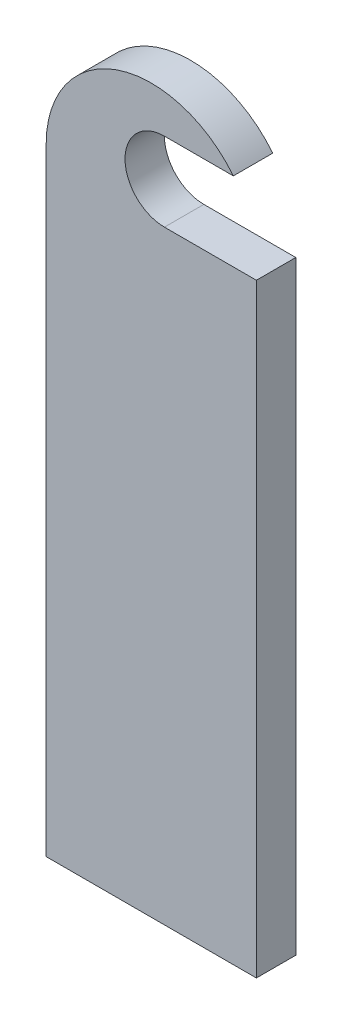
ISO-10303-21;
HEADER;
FILE_DESCRIPTION(('STEP AP214'),'2;1');
FILE_NAME('part.step','',(''),(''),'','','');
FILE_SCHEMA(('AUTOMOTIVE_DESIGN { 1 0 10303 214 1 1 1 1 }'));
ENDSEC;
DATA;
#1=APPLICATION_CONTEXT('core data for automotive mechanical design processes');
#2=APPLICATION_PROTOCOL_DEFINITION('international standard','automotive_design',2000,#1);
#3=PRODUCT_CONTEXT('',#1,'mechanical');
#4=PRODUCT('Part','Part','',(#3));
#5=PRODUCT_RELATED_PRODUCT_CATEGORY('part','',(#4));
#6=PRODUCT_DEFINITION_FORMATION('','',#4);
#7=PRODUCT_DEFINITION_CONTEXT('part definition',#1,'design');
#8=PRODUCT_DEFINITION('design','',#6,#7);
#9=PRODUCT_DEFINITION_SHAPE('','',#8);
#10=(LENGTH_UNIT() NAMED_UNIT(*) SI_UNIT(.MILLI.,.METRE.));
#11=(NAMED_UNIT(*) PLANE_ANGLE_UNIT() SI_UNIT($,.RADIAN.));
#12=(NAMED_UNIT(*) SI_UNIT($,.STERADIAN.) SOLID_ANGLE_UNIT());
#13=UNCERTAINTY_MEASURE_WITH_UNIT(LENGTH_MEASURE(1.E-05),#10,'distance_accuracy_value','');
#14=(GEOMETRIC_REPRESENTATION_CONTEXT(3) GLOBAL_UNCERTAINTY_ASSIGNED_CONTEXT((#13)) GLOBAL_UNIT_ASSIGNED_CONTEXT((#10,
#11,#12)) REPRESENTATION_CONTEXT('',''));
#15=CARTESIAN_POINT('',(0.,0.,0.));
#16=DIRECTION('',(0.,0.,1.));
#17=DIRECTION('',(1.,0.,0.));
#18=AXIS2_PLACEMENT_3D('',#15,#16,#17);
#19=CARTESIAN_POINT('',(-8.00000000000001,47.,3.));
#20=DIRECTION('',(1.,0.,0.));
#21=DIRECTION('',(0.,1.,0.));
#22=AXIS2_PLACEMENT_3D('',#19,#20,#21);
#23=PLANE('',#22);
#24=DIRECTION('',(0.,-1.,0.));
#25=VECTOR('',#24,1.);
#26=CARTESIAN_POINT('',(-8.00000000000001,47.,0.));
#27=LINE('',#26,#25);
#28=CARTESIAN_POINT('',(-8.00000000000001,47.,0.));
#29=VERTEX_POINT('',#28);
#30=CARTESIAN_POINT('',(-8.,0.,0.));
#31=VERTEX_POINT('',#30);
#32=EDGE_CURVE('E123',#29,#31,#27,.T.);
#33=ORIENTED_EDGE('',*,*,#32,.T.);
#34=DIRECTION('',(0.,0.,-1.));
#35=VECTOR('',#34,1.);
#36=CARTESIAN_POINT('',(-8.,0.,3.));
#37=LINE('',#36,#35);
#38=CARTESIAN_POINT('',(-8.,0.,3.));
#39=VERTEX_POINT('',#38);
#40=EDGE_CURVE('E11',#39,#31,#37,.T.);
#41=ORIENTED_EDGE('',*,*,#40,.F.);
#42=DIRECTION('',(0.,-1.,0.));
#43=VECTOR('',#42,1.);
#44=CARTESIAN_POINT('',(-8.00000000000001,47.,3.));
#45=LINE('',#44,#43);
#46=CARTESIAN_POINT('',(-8.00000000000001,47.,3.));
#47=VERTEX_POINT('',#46);
#48=EDGE_CURVE('E135',#47,#39,#45,.T.);
#49=ORIENTED_EDGE('',*,*,#48,.F.);
#50=DIRECTION('',(0.,0.,-1.));
#51=VECTOR('',#50,1.);
#52=CARTESIAN_POINT('',(-8.00000000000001,47.,3.));
#53=LINE('',#52,#51);
#54=EDGE_CURVE('E119',#47,#29,#53,.T.);
#55=ORIENTED_EDGE('',*,*,#54,.T.);
#56=EDGE_LOOP('',(#33,#41,#49,#55));
#57=FACE_BOUND('',#56,.T.);
#58=ADVANCED_FACE('F33',(#57),#23,.F.);
#59=CARTESIAN_POINT('',(-8.,0.,3.));
#60=DIRECTION('',(0.,1.,0.));
#61=DIRECTION('',(0.,0.,1.));
#62=AXIS2_PLACEMENT_3D('',#59,#60,#61);
#63=PLANE('',#62);
#64=DIRECTION('',(1.,0.,0.));
#65=VECTOR('',#64,1.);
#66=CARTESIAN_POINT('',(-8.,0.,0.));
#67=LINE('',#66,#65);
#68=CARTESIAN_POINT('',(8.,0.,0.));
#69=VERTEX_POINT('',#68);
#70=EDGE_CURVE('E126',#31,#69,#67,.T.);
#71=ORIENTED_EDGE('',*,*,#70,.T.);
#72=DIRECTION('',(0.,0.,-1.));
#73=VECTOR('',#72,1.);
#74=CARTESIAN_POINT('',(8.,0.,3.));
#75=LINE('',#74,#73);
#76=CARTESIAN_POINT('',(8.,0.,3.));
#77=VERTEX_POINT('',#76);
#78=EDGE_CURVE('E41',#77,#69,#75,.T.);
#79=ORIENTED_EDGE('',*,*,#78,.F.);
#80=DIRECTION('',(1.,0.,0.));
#81=VECTOR('',#80,1.);
#82=CARTESIAN_POINT('',(-8.,0.,3.));
#83=LINE('',#82,#81);
#84=EDGE_CURVE('E89',#39,#77,#83,.T.);
#85=ORIENTED_EDGE('',*,*,#84,.F.);
#86=ORIENTED_EDGE('',*,*,#40,.T.);
#87=EDGE_LOOP('',(#71,#79,#85,#86));
#88=FACE_BOUND('',#87,.T.);
#89=ADVANCED_FACE('F160',(#88),#63,.F.);
#90=CARTESIAN_POINT('',(8.,0.,3.));
#91=DIRECTION('',(-1.,0.,0.));
#92=DIRECTION('',(0.,-1.,0.));
#93=AXIS2_PLACEMENT_3D('',#90,#91,#92);
#94=PLANE('',#93);
#95=DIRECTION('',(0.,1.,0.));
#96=VECTOR('',#95,1.);
#97=CARTESIAN_POINT('',(8.,0.,0.));
#98=LINE('',#97,#96);
#99=CARTESIAN_POINT('',(7.99999999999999,46.,0.));
#100=VERTEX_POINT('',#99);
#101=EDGE_CURVE('E128',#69,#100,#98,.T.);
#102=ORIENTED_EDGE('',*,*,#101,.T.);
#103=DIRECTION('',(0.,0.,-1.));
#104=VECTOR('',#103,1.);
#105=CARTESIAN_POINT('',(7.99999999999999,46.,3.));
#106=LINE('',#105,#104);
#107=CARTESIAN_POINT('',(7.99999999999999,46.,3.));
#108=VERTEX_POINT('',#107);
#109=EDGE_CURVE('E139',#108,#100,#106,.T.);
#110=ORIENTED_EDGE('',*,*,#109,.F.);
#111=DIRECTION('',(0.,1.,0.));
#112=VECTOR('',#111,1.);
#113=CARTESIAN_POINT('',(8.,0.,3.));
#114=LINE('',#113,#112);
#115=EDGE_CURVE('E147',#77,#108,#114,.T.);
#116=ORIENTED_EDGE('',*,*,#115,.F.);
#117=ORIENTED_EDGE('',*,*,#78,.T.);
#118=EDGE_LOOP('',(#102,#110,#116,#117));
#119=FACE_BOUND('',#118,.T.);
#120=ADVANCED_FACE('F145',(#119),#94,.F.);
#121=CARTESIAN_POINT('',(7.99999999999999,46.,3.));
#122=DIRECTION('',(0.,-1.,0.));
#123=DIRECTION('',(0.,0.,-1.));
#124=AXIS2_PLACEMENT_3D('',#121,#122,#123);
#125=PLANE('',#124);
#126=DIRECTION('',(-1.,0.,0.));
#127=VECTOR('',#126,1.);
#128=CARTESIAN_POINT('',(7.99999999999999,46.,0.));
#129=LINE('',#128,#127);
#130=CARTESIAN_POINT('',(0.999999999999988,46.,0.));
#131=VERTEX_POINT('',#130);
#132=EDGE_CURVE('E130',#100,#131,#129,.T.);
#133=ORIENTED_EDGE('',*,*,#132,.T.);
#134=DIRECTION('',(0.,0.,-1.));
#135=VECTOR('',#134,1.);
#136=CARTESIAN_POINT('',(0.999999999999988,46.,3.));
#137=LINE('',#136,#135);
#138=CARTESIAN_POINT('',(0.999999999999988,46.,3.));
#139=VERTEX_POINT('',#138);
#140=EDGE_CURVE('E114',#139,#131,#137,.T.);
#141=ORIENTED_EDGE('',*,*,#140,.F.);
#142=DIRECTION('',(-1.,0.,0.));
#143=VECTOR('',#142,1.);
#144=CARTESIAN_POINT('',(7.99999999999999,46.,3.));
#145=LINE('',#144,#143);
#146=EDGE_CURVE('E105',#108,#139,#145,.T.);
#147=ORIENTED_EDGE('',*,*,#146,.F.);
#148=ORIENTED_EDGE('',*,*,#109,.T.);
#149=EDGE_LOOP('',(#133,#141,#147,#148));
#150=FACE_BOUND('',#149,.T.);
#151=ADVANCED_FACE('F153',(#150),#125,.F.);
#152=CARTESIAN_POINT('',(0.999999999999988,49.,3.));
#153=DIRECTION('',(0.,0.,-1.));
#154=DIRECTION('',(-1.,0.,0.));
#155=AXIS2_PLACEMENT_3D('',#152,#153,#154);
#156=CYLINDRICAL_SURFACE('',#155,3.);
#157=CARTESIAN_POINT('',(0.999999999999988,49.,0.));
#158=DIRECTION('',(0.,0.,-1.));
#159=DIRECTION('',(-1.,0.,0.));
#160=AXIS2_PLACEMENT_3D('',#157,#158,#159);
#161=CIRCLE('',#160,3.);
#162=CARTESIAN_POINT('',(0.999999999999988,52.,0.));
#163=VERTEX_POINT('',#162);
#164=EDGE_CURVE('E113',#131,#163,#161,.T.);
#165=ORIENTED_EDGE('',*,*,#164,.T.);
#166=DIRECTION('',(0.,0.,-1.));
#167=VECTOR('',#166,1.);
#168=CARTESIAN_POINT('',(0.999999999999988,52.,3.));
#169=LINE('',#168,#167);
#170=CARTESIAN_POINT('',(0.999999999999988,52.,3.));
#171=VERTEX_POINT('',#170);
#172=EDGE_CURVE('E110',#171,#163,#169,.T.);
#173=ORIENTED_EDGE('',*,*,#172,.F.);
#174=CARTESIAN_POINT('',(0.999999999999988,49.,3.));
#175=DIRECTION('',(0.,0.,-1.));
#176=DIRECTION('',(-1.,0.,0.));
#177=AXIS2_PLACEMENT_3D('',#174,#175,#176);
#178=CIRCLE('',#177,3.);
#179=EDGE_CURVE('E99',#139,#171,#178,.T.);
#180=ORIENTED_EDGE('',*,*,#179,.F.);
#181=ORIENTED_EDGE('',*,*,#140,.T.);
#182=EDGE_LOOP('',(#165,#173,#180,#181));
#183=FACE_BOUND('',#182,.T.);
#184=ADVANCED_FACE('F111',(#183),#156,.F.);
#185=CARTESIAN_POINT('',(0.999999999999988,52.,3.));
#186=DIRECTION('',(0.,1.,0.));
#187=DIRECTION('',(-1.,0.,0.));
#188=AXIS2_PLACEMENT_3D('',#185,#186,#187);
#189=PLANE('',#188);
#190=DIRECTION('',(1.,0.,0.));
#191=VECTOR('',#190,1.);
#192=CARTESIAN_POINT('',(0.999999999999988,52.,0.));
#193=LINE('',#192,#191);
#194=CARTESIAN_POINT('',(6.2449979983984,52.,0.));
#195=VERTEX_POINT('',#194);
#196=EDGE_CURVE('E75',#163,#195,#193,.T.);
#197=ORIENTED_EDGE('',*,*,#196,.T.);
#198=DIRECTION('',(0.,0.,-1.));
#199=VECTOR('',#198,1.);
#200=CARTESIAN_POINT('',(6.2449979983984,52.,3.));
#201=LINE('',#200,#199);
#202=CARTESIAN_POINT('',(6.2449979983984,52.,3.));
#203=VERTEX_POINT('',#202);
#204=EDGE_CURVE('E115',#203,#195,#201,.T.);
#205=ORIENTED_EDGE('',*,*,#204,.F.);
#206=DIRECTION('',(1.,0.,0.));
#207=VECTOR('',#206,1.);
#208=CARTESIAN_POINT('',(0.999999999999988,52.,3.));
#209=LINE('',#208,#207);
#210=EDGE_CURVE('E103',#171,#203,#209,.T.);
#211=ORIENTED_EDGE('',*,*,#210,.F.);
#212=ORIENTED_EDGE('',*,*,#172,.T.);
#213=EDGE_LOOP('',(#197,#205,#211,#212));
#214=FACE_BOUND('',#213,.T.);
#215=ADVANCED_FACE('F117',(#214),#189,.F.);
#216=CARTESIAN_POINT('',(0.,47.,3.));
#217=DIRECTION('',(0.,0.,-1.));
#218=DIRECTION('',(-1.,0.,0.));
#219=AXIS2_PLACEMENT_3D('',#216,#217,#218);
#220=CYLINDRICAL_SURFACE('',#219,8.);
#221=CARTESIAN_POINT('',(0.,47.,0.));
#222=DIRECTION('',(0.,0.,1.));
#223=DIRECTION('',(1.,0.,0.));
#224=AXIS2_PLACEMENT_3D('',#221,#222,#223);
#225=CIRCLE('',#224,8.);
#226=EDGE_CURVE('E81',#195,#29,#225,.T.);
#227=ORIENTED_EDGE('',*,*,#226,.T.);
#228=ORIENTED_EDGE('',*,*,#54,.F.);
#229=CARTESIAN_POINT('',(0.,47.,3.));
#230=DIRECTION('',(0.,0.,1.));
#231=DIRECTION('',(1.,0.,0.));
#232=AXIS2_PLACEMENT_3D('',#229,#230,#231);
#233=CIRCLE('',#232,8.);
#234=EDGE_CURVE('E49',#203,#47,#233,.T.);
#235=ORIENTED_EDGE('',*,*,#234,.F.);
#236=ORIENTED_EDGE('',*,*,#204,.T.);
#237=EDGE_LOOP('',(#227,#228,#235,#236));
#238=FACE_BOUND('',#237,.T.);
#239=ADVANCED_FACE('F174',(#238),#220,.T.);
#240=CARTESIAN_POINT('',(0.999999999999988,49.,3.));
#241=DIRECTION('',(0.,0.,-1.));
#242=DIRECTION('',(-1.,0.,0.));
#243=AXIS2_PLACEMENT_3D('',#240,#241,#242);
#244=PLANE('',#243);
#245=ORIENTED_EDGE('',*,*,#48,.T.);
#246=ORIENTED_EDGE('',*,*,#84,.T.);
#247=ORIENTED_EDGE('',*,*,#115,.T.);
#248=ORIENTED_EDGE('',*,*,#146,.T.);
#249=ORIENTED_EDGE('',*,*,#179,.T.);
#250=ORIENTED_EDGE('',*,*,#210,.T.);
#251=ORIENTED_EDGE('',*,*,#234,.T.);
#252=EDGE_LOOP('',(#245,#246,#247,#248,#249,#250,#251));
#253=FACE_BOUND('',#252,.T.);
#254=ADVANCED_FACE('F101',(#253),#244,.F.);
#255=CARTESIAN_POINT('',(0.999999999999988,49.,0.));
#256=DIRECTION('',(0.,0.,-1.));
#257=DIRECTION('',(-1.,0.,0.));
#258=AXIS2_PLACEMENT_3D('',#255,#256,#257);
#259=PLANE('',#258);
#260=ORIENTED_EDGE('',*,*,#32,.F.);
#261=ORIENTED_EDGE('',*,*,#226,.F.);
#262=ORIENTED_EDGE('',*,*,#196,.F.);
#263=ORIENTED_EDGE('',*,*,#164,.F.);
#264=ORIENTED_EDGE('',*,*,#132,.F.);
#265=ORIENTED_EDGE('',*,*,#101,.F.);
#266=ORIENTED_EDGE('',*,*,#70,.F.);
#267=EDGE_LOOP('',(#260,#261,#262,#263,#264,#265,#266));
#268=FACE_BOUND('',#267,.T.);
#269=ADVANCED_FACE('F151',(#268),#259,.T.);
#270=CLOSED_SHELL('',(#58,#89,#120,#151,#184,#215,#239,#254,#269));
#271=MANIFOLD_SOLID_BREP('B2',#270);
#272=ADVANCED_BREP_SHAPE_REPRESENTATION('',(#18,#271),#14);
#273=SHAPE_DEFINITION_REPRESENTATION(#9,#272);
ENDSEC;
END-ISO-10303-21;
